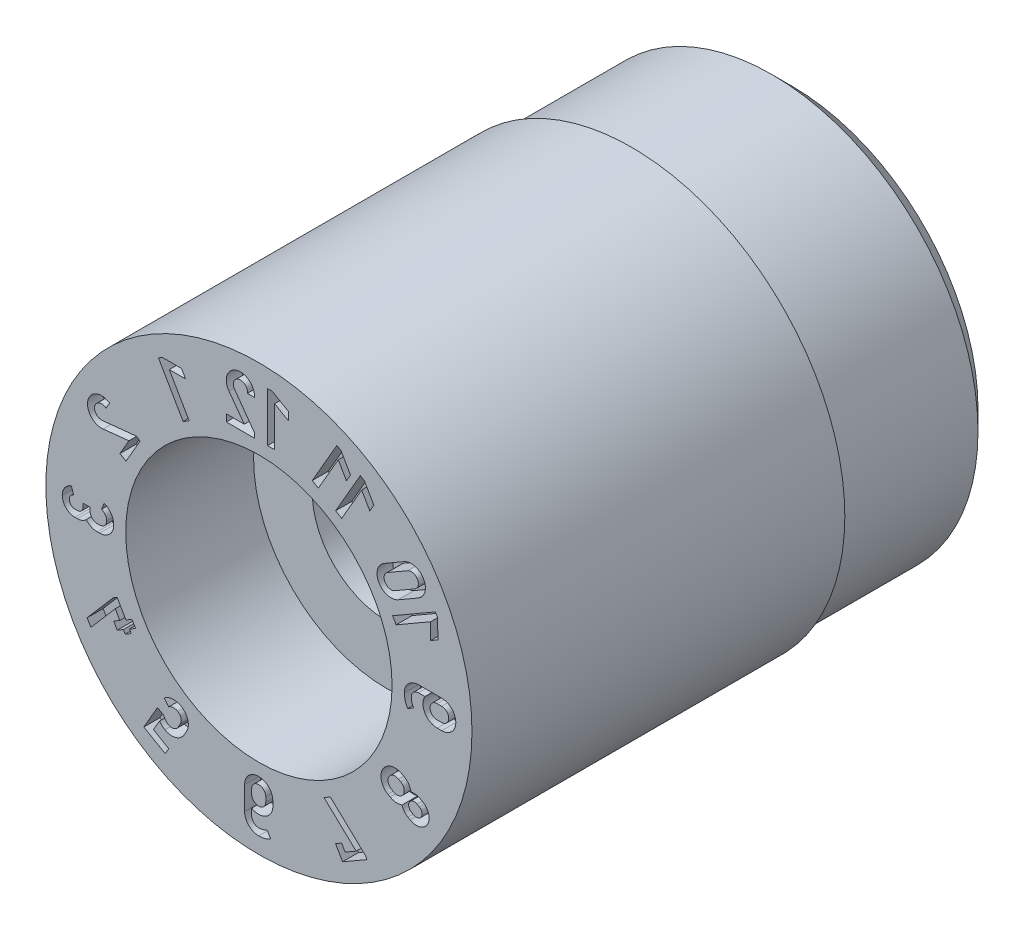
from build123d import *

# Parameters (mm, degrees)
SKETCH5_W          = 1.5
SKETCH5_H          = 1
CUT_EXTRUDE1_DEPTH = 0.15


with BuildPart() as part:
    # Sketch1 → Revolve1 (revolve)
    with BuildSketch(Plane(origin=(0, 0, 0), x_dir=(0, 0, -1), z_dir=(1, 0, 0)), mode=Mode.PRIVATE) as revolve1_sk:
        Polygon((0, 2), (0, 1.25), (1.2, 1.25), (1.2, 0.7), (5, 0.7), (5, 1.75), (4.75, 2), align=None)
    revolve(revolve1_sk.sketch.rotate(Axis((0, 0, 3.797909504), (0, 0, -1)), 90), axis=Axis((0, 0, 3.797909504), (0, 0, -1)))

    # Sketch5 → Cut-Revolve1 (revolve, cut)
    with BuildSketch(Plane(origin=(0, 0, 0), x_dir=(0, 0, -1), z_dir=(1, 0, 0)), mode=Mode.PRIVATE) as cut_revolve1_sk:
        with Locations((4.25, 2.435)):
            Rectangle(SKETCH5_W, SKETCH5_H)
    revolve(cut_revolve1_sk.sketch.rotate(Axis((0, 0, 0), (0, 0, -1)), 90), axis=Axis((0, 0, 0), (0, 0, -1)), mode=Mode.SUBTRACT)

    # Sketch2 → Cut-Extrude1 (cut)
    # profile 1 of 15: a face of its own
    with BuildSketch(Plane.XY):
        Polygon((0.951828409, 1.557133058), (0.989588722, 1.535332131), (1.079316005, 1.380542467), (1.041120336, 1.314385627), (0.964468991, 1.446571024), (0.777357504, 1.122484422), (0.720002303, 1.155598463), align=None)
    # profile 2 of 15: a face of its own
    with BuildSketch(Plane.XY):
        Polygon((0.732308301, 1.692894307), (0.770068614, 1.67109338), (0.859795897, 1.516303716), (0.821600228, 1.450146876), (0.744948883, 1.582332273), (0.557837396, 1.258245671), (0.500482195, 1.291359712), align=None)
    # profile 3 of 15: a face of its own
    with BuildSketch(Plane.XY):
        with BuildLine():
            Line((1.715813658, 0.130713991), (1.497233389, 0.130676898))
            ThreePointArc((1.497233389, 0.130676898), (1.403569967, 0.091874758), (1.364754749, -0.001783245))
            ThreePointArc((1.364754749, -0.001783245), (1.372698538, -0.060219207), (1.395986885, -0.114399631))
            Line((1.395986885, -0.114399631), (1.452862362, -0.080218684))
            ThreePointArc((1.452862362, -0.080218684), (1.435061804, -0.040271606), (1.43118808, 0.003290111))
            ThreePointArc((1.43118808, 0.003290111), (1.452218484, 0.046810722), (1.497221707, 0.064446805))
            Line((1.497221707, 0.064446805), (1.558018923, 0.064441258))
            ThreePointArc((1.558018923, 0.064441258), (1.557751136, -0.068235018), (1.672760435, -0.13438581))
            Line((1.672760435, -0.13438581), (1.715723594, -0.134237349))
            ThreePointArc((1.715723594, -0.134237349), (1.848244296, -0.001806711), (1.715813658, 0.130713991))
        make_face()
        with BuildLine():
            Line((1.715813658, 0.064448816), (1.672768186, 0.064448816))
            ThreePointArc((1.672768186, 0.064448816), (1.606530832, -0.001790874), (1.672772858, -0.068025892))
            Line((1.672772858, -0.068025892), (1.715809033, -0.068025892))
            ThreePointArc((1.715809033, -0.068025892), (1.7820487, -0.00179085), (1.715813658, 0.064448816))
        make_face(mode=Mode.SUBTRACT)
    # profile 4 of 15: a face of its own
    with BuildSketch(Plane.XY):
        Polygon((0.610812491, -1.230594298), (0.670689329, -1.196024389), (0.998826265, -1.505248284), (1.014720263, -1.532777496), (0.785267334, -1.665252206), (0.719029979, -1.550525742), (0.776401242, -1.517402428), (0.809515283, -1.574757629), (0.912757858, -1.515150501), align=None)
    # profile 5 of 15: a face of its own
    with BuildSketch(Plane.XY):
        with BuildLine():
            Line((1.364245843, -0.685293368), (1.344186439, -0.673690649))
            ThreePointArc((1.344186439, -0.673690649), (1.16313076, -0.722126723), (1.211711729, -0.903143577))
            Line((1.211711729, -0.903143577), (1.231773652, -0.914726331))
            ThreePointArc((1.231773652, -0.914726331), (1.286649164, -0.931986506), (1.343667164, -0.924358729))
            ThreePointArc((1.343667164, -0.924358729), (1.364284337, -0.965635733), (1.39901428, -0.996011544))
            Line((1.39901428, -0.996011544), (1.419096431, -1.007586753))
            ThreePointArc((1.419096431, -1.007586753), (1.581914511, -0.963952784), (1.538280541, -0.801134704))
            Line((1.538280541, -0.801134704), (1.518247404, -0.789482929))
            ThreePointArc((1.518247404, -0.789482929), (1.474598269, -0.774508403), (1.428541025, -0.777374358))
            ThreePointArc((1.428541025, -0.777374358), (1.406633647, -0.724183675), (1.364245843, -0.685293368))
        make_face()
        with BuildLine():
            Line((1.4321245, -0.938661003), (1.452206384, -0.950233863))
            ThreePointArc((1.452206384, -0.950233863), (1.524586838, -0.930839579), (1.505192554, -0.858459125))
            Line((1.505192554, -0.858459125), (1.485129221, -0.846854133))
            ThreePointArc((1.485129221, -0.846854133), (1.412649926, -0.866212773), (1.4321245, -0.938661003))
        make_face(mode=Mode.SUBTRACT)
        with BuildLine():
            Line((1.244814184, -0.845786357), (1.264905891, -0.857386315))
            ThreePointArc((1.264905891, -0.857386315), (1.355372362, -0.833134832), (1.331120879, -0.742668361))
            Line((1.331120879, -0.742668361), (1.311060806, -0.731043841))
            ThreePointArc((1.311060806, -0.731043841), (1.220590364, -0.755305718), (1.244814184, -0.845786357))
        make_face(mode=Mode.SUBTRACT)
    # profile 6 of 15: a face of its own
    with BuildSketch(Plane.XY):
        Polygon((1.656804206, 0.801897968), (1.678605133, 0.764137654), (1.678916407, 0.585222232), (1.612759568, 0.547026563), (1.612470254, 0.699828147), (1.288383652, 0.51271666), (1.255269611, 0.570071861), align=None)
    # profile 7 of 15: a face of its own
    with BuildSketch(Plane.XY):
        with BuildLine():
            Line((1.364311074, 1.064376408), (1.175016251, 0.955086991))
            ThreePointArc((1.175016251, 0.955086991), (1.126510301, 0.774095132), (1.307504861, 0.725599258))
            Line((1.307504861, 0.725599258), (1.49680433, 0.834891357))
            ThreePointArc((1.49680433, 0.834891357), (1.545300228, 1.015880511), (1.364311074, 1.064376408))
        make_face()
        with BuildLine():
            Line((1.274381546, 0.782970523), (1.463681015, 0.892262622))
            ThreePointArc((1.463681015, 0.892262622), (1.487922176, 0.982731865), (1.397452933, 1.006973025))
            Line((1.397452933, 1.006973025), (1.208130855, 0.897710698))
            ThreePointArc((1.208130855, 0.897710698), (1.18388408, 0.807214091), (1.274381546, 0.782970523))
        make_face(mode=Mode.SUBTRACT)
    # profile 8 of 15: a face of its own
    with BuildSketch(Plane.XY):
        Polygon((0.081290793, 1.829286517), (0.124892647, 1.829286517), (0.279993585, 1.740098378), (0.279993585, 1.663707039), (0.147518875, 1.739857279), (0.147518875, 1.365634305), (0.081290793, 1.365634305), align=None)
    # profile 9 of 15: a face of its own
    with BuildSketch(Plane.XY):
        with BuildLine():
            Line((-0.305967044, 1.364618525), (-0.041017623, 1.364618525))
            Line((-0.041017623, 1.364618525), (-0.041017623, 1.408424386))
            Line((-0.041017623, 1.408424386), (-0.22727599, 1.667012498))
            ThreePointArc((-0.22727599, 1.667012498), (-0.189057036, 1.770145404), (-0.108006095, 1.695796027))
            Line((-0.108006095, 1.695796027), (-0.041385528, 1.695794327))
            ThreePointArc((-0.041385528, 1.695794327), (-0.20949629, 1.833224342), (-0.281110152, 1.628237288))
            Line((-0.281110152, 1.628237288), (-0.13704927, 1.430865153))
            Line((-0.13704927, 1.430865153), (-0.305967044, 1.430865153))
            Line((-0.305967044, 1.430865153), (-0.305967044, 1.364618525))
        make_face()
    # profile 10 of 15: a face of its own
    with BuildSketch(Plane.XY):
        Polygon((-0.943121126, 1.567305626), (-0.905360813, 1.589106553), (-0.72644539, 1.589417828), (-0.688249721, 1.523260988), (-0.841051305, 1.522971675), (-0.653939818, 1.198885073), (-0.71129502, 1.165771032), align=None)
    # profile 11 of 15: a face of its own
    with BuildSketch(Plane.XY):
        with BuildLine():
            Line((0.130645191, -1.497368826), (0.130793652, -1.540331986))
            ThreePointArc((0.130793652, -1.540331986), (0.06464286, -1.655341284), (-0.068033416, -1.655073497))
            Line((-0.068033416, -1.655073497), (-0.068038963, -1.715870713))
            ThreePointArc((-0.068038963, -1.715870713), (-0.05040288, -1.760873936), (-0.006882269, -1.78190434))
            ThreePointArc((-0.006882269, -1.78190434), (0.036676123, -1.778031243), (0.076620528, -1.760232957))
            Line((0.076620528, -1.760232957), (0.110809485, -1.817113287))
            ThreePointArc((0.110809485, -1.817113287), (0.056629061, -1.840401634), (-0.001806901, -1.848345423))
            ThreePointArc((-0.001806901, -1.848345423), (-0.095464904, -1.809530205), (-0.134267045, -1.715866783))
            Line((-0.134267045, -1.715866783), (-0.134304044, -1.497278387))
            ThreePointArc((-0.134304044, -1.497278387), (-0.001784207, -1.364848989), (0.130645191, -1.497368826))
        make_face()
        with BuildLine():
            Line((-0.068038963, -1.497286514), (-0.068038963, -1.540331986))
            ThreePointArc((-0.068038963, -1.540331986), (-0.001799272, -1.60656934), (0.064435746, -1.540327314))
            Line((0.064435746, -1.540327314), (0.064435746, -1.497291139))
            ThreePointArc((0.064435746, -1.497291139), (-0.001799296, -1.431051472), (-0.068038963, -1.497286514))
        make_face(mode=Mode.SUBTRACT)
    # profile 12 of 15: a face of its own
    with BuildSketch(Plane.XY):
        with BuildLine():
            Line((-0.680334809, -1.339640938), (-0.701899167, -1.37688023))
            ThreePointArc((-0.701899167, -1.37688023), (-0.782335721, -1.438532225), (-0.882827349, -1.425400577))
            ThreePointArc((-0.882827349, -1.425400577), (-0.910388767, -1.405489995), (-0.93325853, -1.38032977))
            Line((-0.93325853, -1.38032977), (-0.989850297, -1.478331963))
            Line((-0.989850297, -1.478331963), (-0.846438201, -1.561130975))
            Line((-0.846438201, -1.561130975), (-0.879561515, -1.618502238))
            Line((-0.879561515, -1.618502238), (-1.080328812, -1.502589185))
            Line((-1.080328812, -1.502589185), (-0.951767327, -1.27991416))
            Line((-0.951767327, -1.27991416), (-0.894412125, -1.313028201))
            ThreePointArc((-0.894412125, -1.313028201), (-0.877125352, -1.344661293), (-0.849697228, -1.368053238))
            ThreePointArc((-0.849697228, -1.368053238), (-0.799438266, -1.374673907), (-0.759231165, -1.343800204))
            Line((-0.759231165, -1.343800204), (-0.737689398, -1.306525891))
            ThreePointArc((-0.737689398, -1.306525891), (-0.731062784, -1.256260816), (-0.761940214, -1.216047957))
            ThreePointArc((-0.761940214, -1.216047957), (-0.805649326, -1.206065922), (-0.847409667, -1.222381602))
            Line((-0.847409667, -1.222381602), (-0.888647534, -1.170476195))
            ThreePointArc((-0.888647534, -1.170476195), (-0.810554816, -1.139942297), (-0.728823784, -1.158672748))
            ThreePointArc((-0.728823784, -1.158672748), (-0.667135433, -1.23912406), (-0.680334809, -1.339640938))
        make_face()
    # profile 13 of 15: a face of its own
    with BuildSketch(Plane.XY):
        with BuildLine():
            Line((-1.726796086, -0.120680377), (-1.703622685, -0.120680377))
            ThreePointArc((-1.703622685, -0.120680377), (-1.65836935, -0.111754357), (-1.619894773, -0.086313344))
            ThreePointArc((-1.619894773, -0.086313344), (-1.574328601, -0.121437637), (-1.518166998, -0.13392228))
            Line((-1.518166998, -0.13392228), (-1.494975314, -0.13392228))
            ThreePointArc((-1.494975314, -0.13392228), (-1.401310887, -0.095121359), (-1.362523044, -0.001451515))
            ThreePointArc((-1.362523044, -0.001451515), (-1.387202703, 0.078666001), (-1.452671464, 0.131027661))
            Line((-1.452671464, 0.131027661), (-1.476974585, 0.069428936))
            ThreePointArc((-1.476974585, 0.069428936), (-1.441950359, 0.041419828), (-1.428751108, -0.001440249))
            ThreePointArc((-1.428751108, -0.001440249), (-1.448151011, -0.048275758), (-1.49498652, -0.067675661))
            Line((-1.49498652, -0.067675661), (-1.518169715, -0.067675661))
            ThreePointArc((-1.518169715, -0.067675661), (-1.564994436, -0.048280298), (-1.584389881, -0.00145561))
            Line((-1.584389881, -0.00145561), (-1.584389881, 0.031657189))
            Line((-1.584389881, 0.031657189), (-1.65063651, 0.031657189))
            Line((-1.65063651, 0.031657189), (-1.65063651, -0.001447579))
            ThreePointArc((-1.65063651, -0.001447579), (-1.666155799, -0.038914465), (-1.703622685, -0.054433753))
            Line((-1.703622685, -0.054433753), (-1.726802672, -0.054433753))
            ThreePointArc((-1.726802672, -0.054433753), (-1.764256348, -0.038901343), (-1.779791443, -0.00144878))
            ThreePointArc((-1.779791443, -0.00144878), (-1.768627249, 0.033315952), (-1.739267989, 0.055024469))
            Line((-1.739267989, 0.055024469), (-1.760466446, 0.11778522))
            ThreePointArc((-1.760466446, 0.11778522), (-1.822418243, 0.071931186), (-1.846030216, -0.001438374))
            ThreePointArc((-1.846030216, -0.001438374), (-1.811115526, -0.08576012), (-1.726796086, -0.120680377))
        make_face()
    # profile 14 of 15: a face of its own
    with BuildSketch(Plane.XY):
        Polygon((-1.612208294, -0.88004217), (-1.577128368, -0.940802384), (-1.348276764, -0.674829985), (-1.305370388, -0.749146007), (-1.36272559, -0.782260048), (-1.329611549, -0.83961525), (-1.272256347, -0.806501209), (-1.25569469, -0.83518684), (-1.198339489, -0.802072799), (-1.214901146, -0.773387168), (-1.157529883, -0.740263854), (-1.190643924, -0.682908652), (-1.248015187, -0.716031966), (-1.330814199, -0.572619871), (-1.364350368, -0.591981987), align=None)
    # profile 15 of 15: a face of its own
    with BuildSketch(Plane.XY):
        with BuildLine():
            Line((-1.304518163, 0.608407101), (-1.2471469, 0.575283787))
            Line((-1.2471469, 0.575283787), (-1.114672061, 0.804736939))
            Line((-1.114672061, 0.804736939), (-1.152608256, 0.826639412))
            Line((-1.152608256, 0.826639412), (-1.469681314, 0.794628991))
            ThreePointArc((-1.469681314, 0.794628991), (-1.539884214, 0.879290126), (-1.434975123, 0.912305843))
            Line((-1.434975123, 0.912305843), (-1.401664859, 0.970004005))
            ThreePointArc((-1.401664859, 0.970004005), (-1.604734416, 0.893130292), (-1.463019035, 0.72862022))
            Line((-1.463019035, 0.72862022), (-1.220059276, 0.754694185))
            Line((-1.220059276, 0.754694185), (-1.304518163, 0.608407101))
        make_face()
    extrude(amount=-CUT_EXTRUDE1_DEPTH, mode=Mode.SUBTRACT)


solid = part.part
